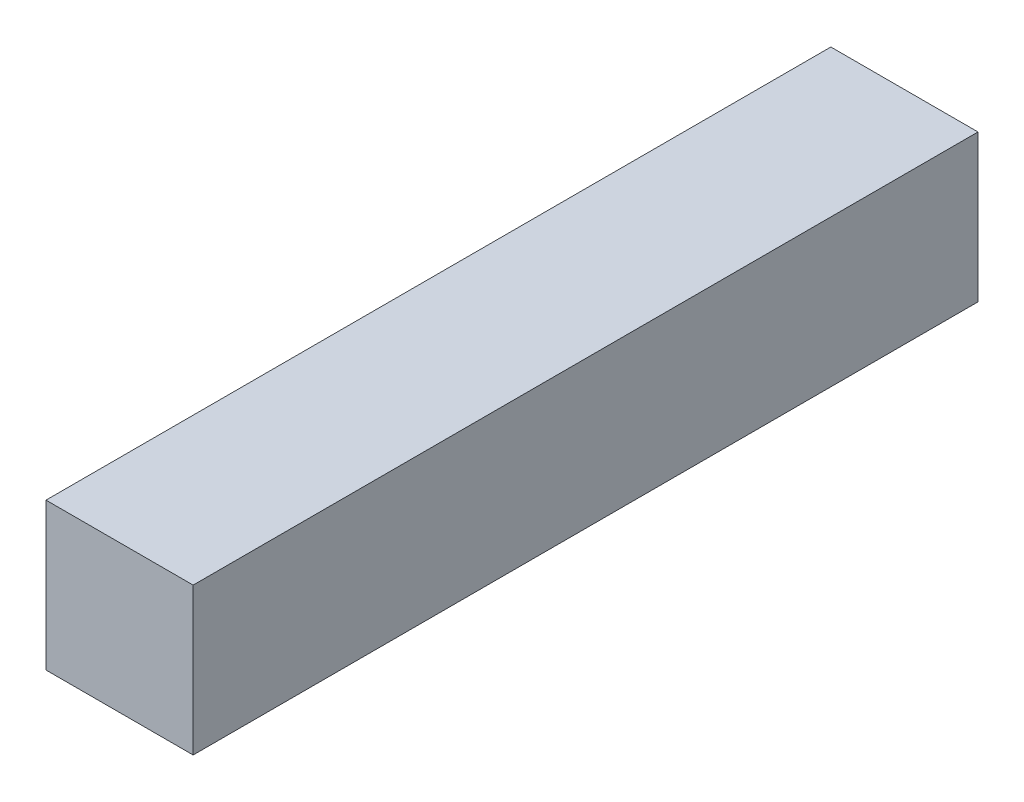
from build123d import *

# Parameters (mm, degrees)
SKETCH1_W           = 4.7625
SKETCH1_H           = 4.7625
BOSS_EXTRUDE1_DEPTH = 25.4


with BuildPart() as part:
    # Sketch1 → Boss-Extrude1 (new body)
    with BuildSketch(Plane.XY):
        Rectangle(SKETCH1_W, SKETCH1_H)
    extrude(amount=BOSS_EXTRUDE1_DEPTH)


solid = part.part
